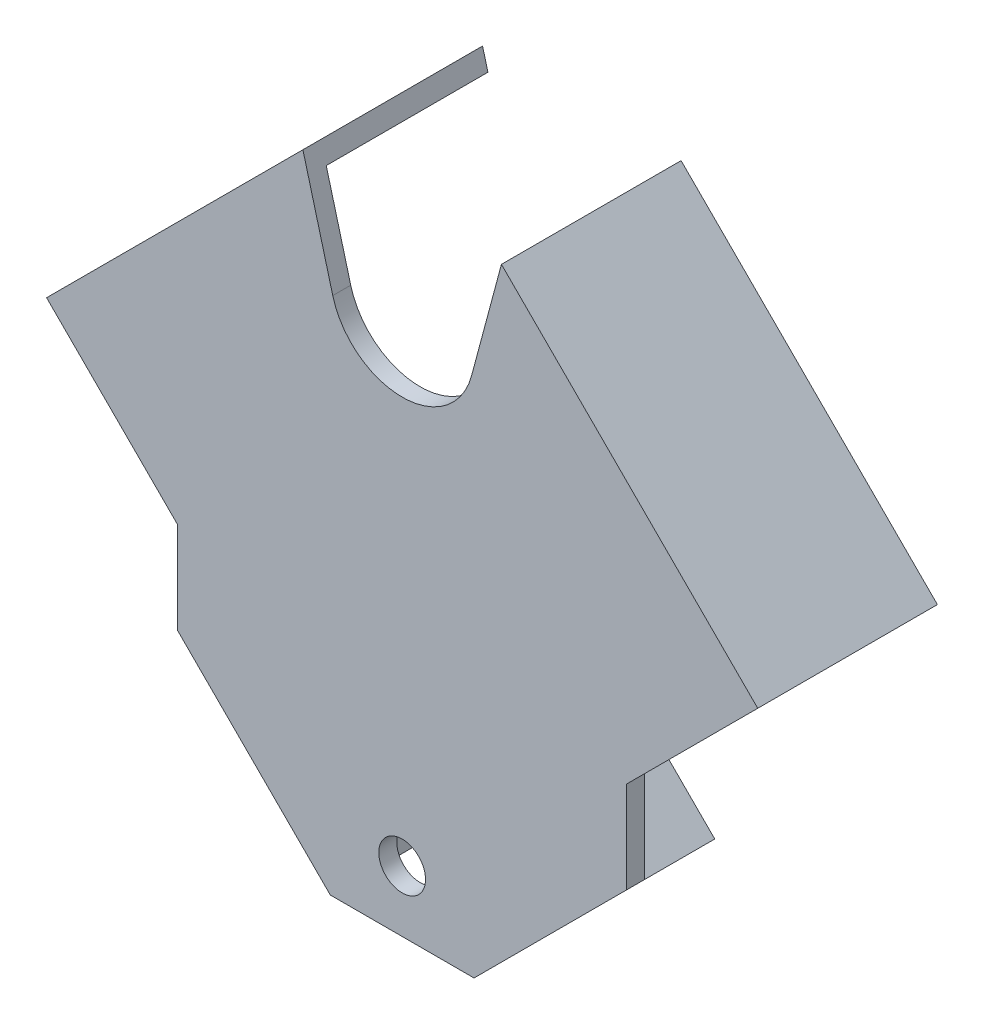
from build123d import *

# Parameters (mm, degrees)
SKETCH1_R                = 6.5
BOSS_EXTRUDE1_DEPTH      = 2.5
BOSS_EXTRUDE2_DEPTH      = 45
BOSS_EXTRUDE2_DEPTH_BACK = 5
BOSS_EXTRUDE3_DEPTH      = 45
CUT_EXTRUDE1_DEPTH       = 208.274941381
CUT_EXTRUDE1_DEPTH_BACK  = 208.274941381
FILLET1_R                = 3


with BuildPart() as part:
    # Sketch1 → Boss-Extrude1 (new, symmetric)
    with BuildSketch(Plane.XY):
        with BuildLine():
            Line((62.5, 42.5), (20, 0))
            Line((20, 0), (-20, 0))
            Line((-20, 0), (-62.5, 42.5))
            Line((-62.5, 42.5), (-62.5, 68.02163877))
            Line((-62.5, 68.02163877), (-95.426518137, 100.948156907))
            Line((-95.426518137, 100.948156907), (-26.13005358, 170.244621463))
            Line((-26.13005358, 170.244621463), (-19.318516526, 144.823619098))
            ThreePointArc((-19.318516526, 144.823619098), (0, 130), (19.318516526, 144.823619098))
            Line((19.318516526, 144.823619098), (26.13005358, 170.244621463))
            Line((26.13005358, 170.244621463), (95.426518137, 100.948156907))
            Line((95.426518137, 100.948156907), (62.5, 68.02163877))
            Line((62.5, 68.02163877), (62.5, 42.5))
        make_face()
        with Locations((0, 17)):
            Circle(SKETCH1_R, mode=Mode.SUBTRACT)
    extrude(amount=BOSS_EXTRUDE1_DEPTH, both=True)

    # Sketch2 → Boss-Extrude2 (add, two sides: drawn at the far end of the back side and taken through both)
    with BuildSketch(Plane(origin=(0, 0, -2.5), x_dir=(-1, 0, 0), z_dir=(0, 0, -1)).offset(-BOSS_EXTRUDE2_DEPTH_BACK)):
        Polygon((-26.13005358, 170.244621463), (-95.426518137, 100.948156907), (-98.962052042, 104.483690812), (-27.624346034, 175.821396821), align=None)
        Polygon((95.426518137, 100.948156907), (98.962052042, 104.483690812), (27.624346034, 175.821396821), (26.13005358, 170.244621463), align=None)
    extrude(amount=BOSS_EXTRUDE2_DEPTH + BOSS_EXTRUDE2_DEPTH_BACK)

    # Sketch3 → Boss-Extrude3 (add)
    with BuildSketch(Plane(origin=(0, 0, -2.5), x_dir=(-1, 0, 0), z_dir=(0, 0, -1))):
        with BuildLine():
            Line((-20, 0), (-37, 17))
            Line((-37, 17), (-7.071067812, 46.928932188))
            ThreePointArc((-7.071067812, 46.928932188), (0, 49.857864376), (7.071067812, 46.928932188))
            Line((7.071067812, 46.928932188), (37, 17))
            Line((37, 17), (20, 0))
            Line((20, 0), (20, 7.071067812))
            Line((20, 7.071067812), (29.928932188, 17))
            Line((29.928932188, 17), (3.535533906, 43.393398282))
            ThreePointArc((3.535533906, 43.393398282), (0, 44.857864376), (-3.535533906, 43.393398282))
            Line((-3.535533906, 43.393398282), (-29.928932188, 17))
            Line((-29.928932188, 17), (-20, 7.071067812))
            Line((-20, 7.071067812), (-20, 0))
        make_face()
    extrude(amount=BOSS_EXTRUDE3_DEPTH)

    # Sketch4 → Cut-Extrude1 (cut, two sides: drawn at the far end of the back side and taken through both)
    with BuildSketch(Plane(origin=(0, 0, 0), x_dir=(0, 0, -1), z_dir=(1, 0, 0)).offset(-CUT_EXTRUDE1_DEPTH_BACK)):
        with BuildLine():
            Line((14.5, 45), (14.5, 49.857864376))
            Line((14.5, 49.857864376), (30.5, 49.857864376))
            Line((30.5, 49.857864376), (30.5, 45))
            ThreePointArc((30.5, 45), (22.5, 37), (14.5, 45))
        make_face()
    extrude(amount=CUT_EXTRUDE1_DEPTH + CUT_EXTRUDE1_DEPTH_BACK, mode=Mode.SUBTRACT)

    # Fillet1
    fillet1_edges = [part.edges().sort_by_distance(p)[0] for p in [
        (29.928932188, 17, -25),
        (-29.928932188, 17, -25),
    ]]
    fillet(fillet1_edges, radius=FILLET1_R)


solid = part.part
